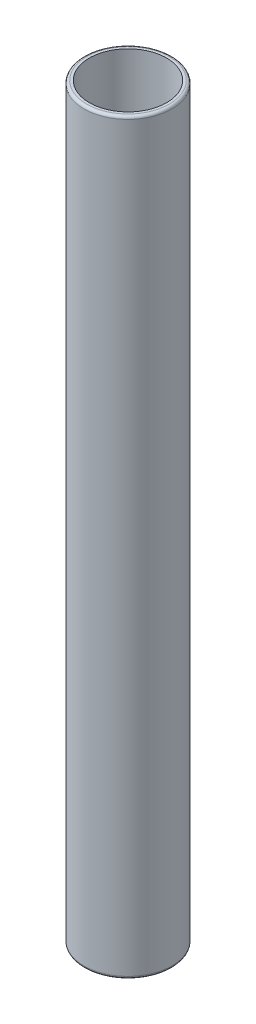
ISO-10303-21;
HEADER;
FILE_DESCRIPTION(('STEP AP214'),'2;1');
FILE_NAME('part.step','',(''),(''),'','','');
FILE_SCHEMA(('AUTOMOTIVE_DESIGN { 1 0 10303 214 1 1 1 1 }'));
ENDSEC;
DATA;
#1=APPLICATION_CONTEXT('core data for automotive mechanical design processes');
#2=APPLICATION_PROTOCOL_DEFINITION('international standard','automotive_design',2000,#1);
#3=PRODUCT_CONTEXT('',#1,'mechanical');
#4=PRODUCT('Part','Part','',(#3));
#5=PRODUCT_RELATED_PRODUCT_CATEGORY('part','',(#4));
#6=PRODUCT_DEFINITION_FORMATION('','',#4);
#7=PRODUCT_DEFINITION_CONTEXT('part definition',#1,'design');
#8=PRODUCT_DEFINITION('design','',#6,#7);
#9=PRODUCT_DEFINITION_SHAPE('','',#8);
#10=(LENGTH_UNIT() NAMED_UNIT(*) SI_UNIT(.MILLI.,.METRE.));
#11=(NAMED_UNIT(*) PLANE_ANGLE_UNIT() SI_UNIT($,.RADIAN.));
#12=(NAMED_UNIT(*) SI_UNIT($,.STERADIAN.) SOLID_ANGLE_UNIT());
#13=UNCERTAINTY_MEASURE_WITH_UNIT(LENGTH_MEASURE(1.E-05),#10,'distance_accuracy_value','');
#14=(GEOMETRIC_REPRESENTATION_CONTEXT(3) GLOBAL_UNCERTAINTY_ASSIGNED_CONTEXT((#13)) GLOBAL_UNIT_ASSIGNED_CONTEXT((#10,
#11,#12)) REPRESENTATION_CONTEXT('',''));
#15=CARTESIAN_POINT('',(0.,0.,0.));
#16=DIRECTION('',(0.,0.,1.));
#17=DIRECTION('',(1.,0.,0.));
#18=AXIS2_PLACEMENT_3D('',#15,#16,#17);
#19=CARTESIAN_POINT('',(0.,53.975,0.));
#20=DIRECTION('',(0.,1.,0.));
#21=DIRECTION('',(0.,0.,1.));
#22=AXIS2_PLACEMENT_3D('',#19,#20,#21);
#23=PLANE('',#22);
#24=CARTESIAN_POINT('',(0.,53.975,0.));
#25=DIRECTION('',(0.,1.,0.));
#26=DIRECTION('',(0.,0.,1.));
#27=AXIS2_PLACEMENT_3D('',#24,#25,#26);
#28=CIRCLE('',#27,2.9765625);
#29=CARTESIAN_POINT('',(0.,53.975,2.9765625));
#30=VERTEX_POINT('',#29);
#31=EDGE_CURVE('E45',#30,#30,#28,.T.);
#32=ORIENTED_EDGE('',*,*,#31,.T.);
#33=EDGE_LOOP('',(#32));
#34=FACE_BOUND('',#33,.T.);
#35=CARTESIAN_POINT('',(0.,53.975,0.));
#36=DIRECTION('',(0.,1.,0.));
#37=DIRECTION('',(0.,0.,1.));
#38=AXIS2_PLACEMENT_3D('',#35,#36,#37);
#39=CIRCLE('',#38,2.794);
#40=CARTESIAN_POINT('',(0.,53.975,2.794));
#41=VERTEX_POINT('',#40);
#42=EDGE_CURVE('E50',#41,#41,#39,.T.);
#43=ORIENTED_EDGE('',*,*,#42,.F.);
#44=EDGE_LOOP('',(#43));
#45=FACE_BOUND('',#44,.T.);
#46=ADVANCED_FACE('F30',(#34,#45),#23,.T.);
#47=CARTESIAN_POINT('',(0.,0.,0.));
#48=DIRECTION('',(0.,1.,0.));
#49=DIRECTION('',(0.,0.,1.));
#50=AXIS2_PLACEMENT_3D('',#47,#48,#49);
#51=PLANE('',#50);
#52=CARTESIAN_POINT('',(0.,0.,0.));
#53=DIRECTION('',(0.,1.,0.));
#54=DIRECTION('',(0.,0.,1.));
#55=AXIS2_PLACEMENT_3D('',#52,#53,#54);
#56=CIRCLE('',#55,2.9765625);
#57=CARTESIAN_POINT('',(0.,0.,2.9765625));
#58=VERTEX_POINT('',#57);
#59=EDGE_CURVE('E10',#58,#58,#56,.F.);
#60=ORIENTED_EDGE('',*,*,#59,.T.);
#61=EDGE_LOOP('',(#60));
#62=FACE_BOUND('',#61,.T.);
#63=CARTESIAN_POINT('',(0.,0.,0.));
#64=DIRECTION('',(0.,1.,0.));
#65=DIRECTION('',(0.,0.,1.));
#66=AXIS2_PLACEMENT_3D('',#63,#64,#65);
#67=CIRCLE('',#66,2.794);
#68=CARTESIAN_POINT('',(0.,0.,2.794));
#69=VERTEX_POINT('',#68);
#70=EDGE_CURVE('E51',#69,#69,#67,.T.);
#71=ORIENTED_EDGE('',*,*,#70,.T.);
#72=EDGE_LOOP('',(#71));
#73=FACE_BOUND('',#72,.T.);
#74=ADVANCED_FACE('F61',(#62,#73),#51,.F.);
#75=CARTESIAN_POINT('',(0.,53.975,0.));
#76=DIRECTION('',(0.,-1.,0.));
#77=DIRECTION('',(0.,0.,-1.));
#78=AXIS2_PLACEMENT_3D('',#75,#76,#77);
#79=CYLINDRICAL_SURFACE('',#78,3.175);
#80=CARTESIAN_POINT('',(0.,53.7765625,0.));
#81=DIRECTION('',(0.,1.,0.));
#82=DIRECTION('',(0.,0.,1.));
#83=AXIS2_PLACEMENT_3D('',#80,#81,#82);
#84=CIRCLE('',#83,3.175);
#85=CARTESIAN_POINT('',(0.,53.7765625,3.175));
#86=VERTEX_POINT('',#85);
#87=EDGE_CURVE('E37',#86,#86,#84,.F.);
#88=ORIENTED_EDGE('',*,*,#87,.T.);
#89=EDGE_LOOP('',(#88));
#90=FACE_BOUND('',#89,.T.);
#91=CARTESIAN_POINT('',(0.,0.198437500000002,0.));
#92=DIRECTION('',(0.,1.,0.));
#93=DIRECTION('',(0.,0.,1.));
#94=AXIS2_PLACEMENT_3D('',#91,#92,#93);
#95=CIRCLE('',#94,3.175);
#96=CARTESIAN_POINT('',(0.,0.198437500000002,3.175));
#97=VERTEX_POINT('',#96);
#98=EDGE_CURVE('E41',#97,#97,#95,.T.);
#99=ORIENTED_EDGE('',*,*,#98,.T.);
#100=EDGE_LOOP('',(#99));
#101=FACE_BOUND('',#100,.T.);
#102=ADVANCED_FACE('F67',(#90,#101),#79,.T.);
#103=CARTESIAN_POINT('',(0.,53.975,0.));
#104=DIRECTION('',(0.,-1.,0.));
#105=DIRECTION('',(0.,0.,-1.));
#106=AXIS2_PLACEMENT_3D('',#103,#104,#105);
#107=CYLINDRICAL_SURFACE('',#106,2.794);
#108=ORIENTED_EDGE('',*,*,#42,.T.);
#109=EDGE_LOOP('',(#108));
#110=FACE_BOUND('',#109,.T.);
#111=ORIENTED_EDGE('',*,*,#70,.F.);
#112=EDGE_LOOP('',(#111));
#113=FACE_BOUND('',#112,.T.);
#114=ADVANCED_FACE('F57',(#110,#113),#107,.F.);
#115=CARTESIAN_POINT('',(0.,53.7765625,0.));
#116=DIRECTION('',(0.,1.,0.));
#117=DIRECTION('',(0.,0.,1.));
#118=AXIS2_PLACEMENT_3D('',#115,#116,#117);
#119=TOROIDAL_SURFACE('',#118,2.9765625,0.1984375);
#120=ORIENTED_EDGE('',*,*,#87,.F.);
#121=EDGE_LOOP('',(#120));
#122=FACE_BOUND('',#121,.T.);
#123=ORIENTED_EDGE('',*,*,#31,.F.);
#124=EDGE_LOOP('',(#123));
#125=FACE_BOUND('',#124,.T.);
#126=ADVANCED_FACE('F72',(#122,#125),#119,.T.);
#127=CARTESIAN_POINT('',(0.,0.198437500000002,0.));
#128=DIRECTION('',(0.,1.,0.));
#129=DIRECTION('',(0.,0.,1.));
#130=AXIS2_PLACEMENT_3D('',#127,#128,#129);
#131=TOROIDAL_SURFACE('',#130,2.9765625,0.1984375);
#132=ORIENTED_EDGE('',*,*,#59,.F.);
#133=EDGE_LOOP('',(#132));
#134=FACE_BOUND('',#133,.T.);
#135=ORIENTED_EDGE('',*,*,#98,.F.);
#136=EDGE_LOOP('',(#135));
#137=FACE_BOUND('',#136,.T.);
#138=ADVANCED_FACE('F32',(#134,#137),#131,.T.);
#139=CLOSED_SHELL('',(#46,#74,#102,#114,#126,#138));
#140=MANIFOLD_SOLID_BREP('B2',#139);
#141=ADVANCED_BREP_SHAPE_REPRESENTATION('',(#18,#140),#14);
#142=SHAPE_DEFINITION_REPRESENTATION(#9,#141);
ENDSEC;
END-ISO-10303-21;
